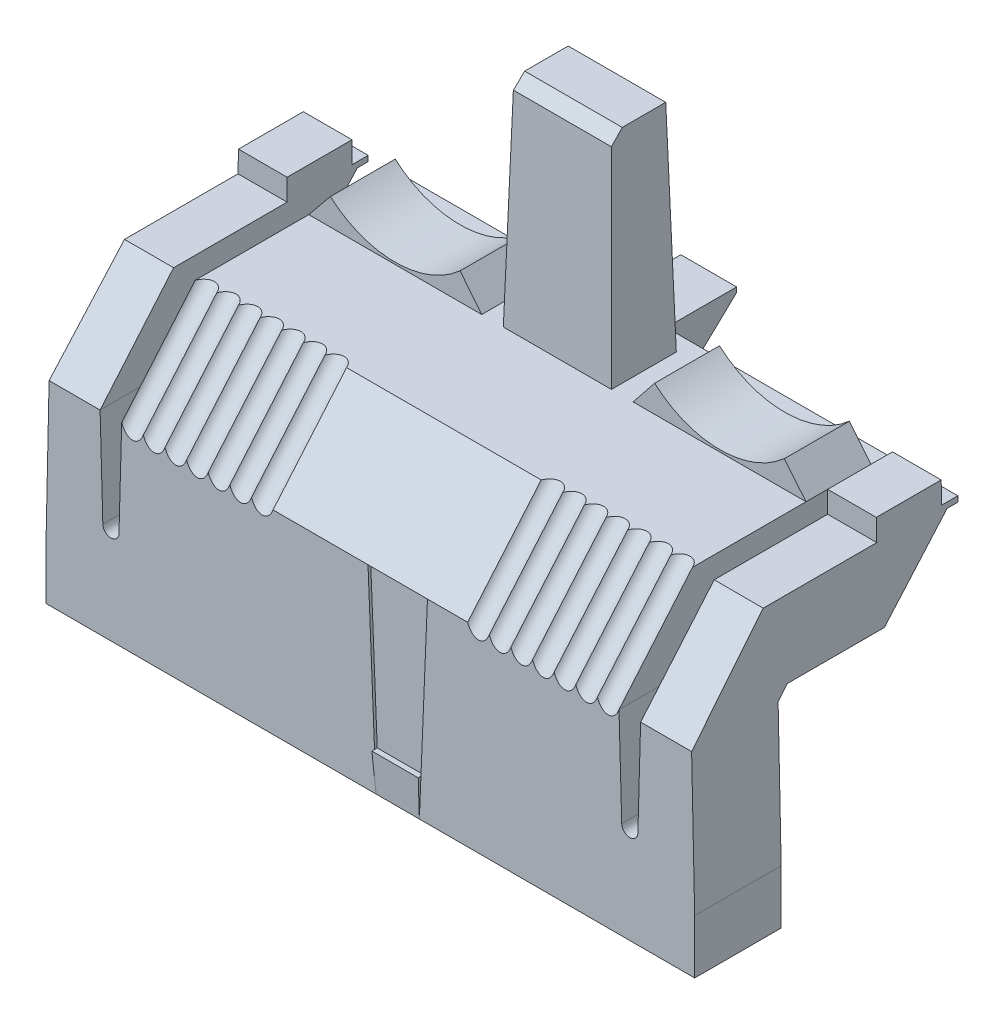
from build123d import *

# Parameters (mm, degrees)
EXTRUSION1_DEPTH        = 30
ENL_V_MAT_EXTRU_1_DEPTH = 54.019585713
ESQUISSE4_R             = 9
ENL_V_MAT_EXTRU_2_DEPTH = 54.019585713
D_POUILLE3_ANGLE        = 1.4
D_POUILLE4_ANGLE        = 1.4
D_POUILLE5_ANGLE        = 1.4
D_POUILLE6_ANGLE        = 1.4
CHANFREIN2_SIZE         = 1
CHANFREIN2_SIZE2        = 1.025357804
EXTRUSION2_DEPTH        = 2.25
ESQUISSE8_W             = 6.5
ESQUISSE8_H             = 0.5
EXTRUSION3_DEPTH        = 4.5
D_POUILLE7_ANGLE        = 2.7
D_POUILLE8_ANGLE        = 2.7
ENL_V_MAT_EXTRU_4_DEPTH = 0.25
EXTRUSION4_DEPTH        = 0.5
ENL_V_MAT_EXTRU_6_DEPTH = 55.234031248
EXTRUSION5_DEPTH        = 1
ESQUISSE13_W            = 1
ESQUISSE13_H            = 20.72029686
EXTRUSION6_DEPTH        = 1
ESQUISSE14_W            = 5
ESQUISSE14_H            = 3.5
ENL_V_MAT_EXTRU_8_DEPTH = 3
ENL_V_MAT_EXTRU_9_DEPTH = 25


with BuildPart() as part:
    # Esquisse1 → Extrusion1 (new, symmetric)
    with BuildSketch(Plane(origin=(0, 0, 0), x_dir=(0, 0, -1), z_dir=(1, 0, 0))):
        Polygon((-4, -10), (4, -10), (4, 8), (4.850091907, 9), (13.850091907, 9), (19.800735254, 15.5), (20.800735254, 15.5), (20.800735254, 16), (19.300735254, 16), (19.300735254, 36), (13.300735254, 36), (13.300735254, 16), (2.800735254, 16), (-4, 8), align=None)
    extrude(amount=EXTRUSION1_DEPTH, both=True)

    # Esquisse3 → Enl_v. mat.-Extru.1 (cut, through all)
    with BuildSketch(Plane.XY.offset(4)):
        with BuildLine():
            Line((-30, -5), (-30, 37.01927998))
            Line((-30, 37.01927998), (-5, 37.01927998))
            Line((-5, 37.01927998), (-5, 16))
            Line((-5, 16), (-7, 16))
            Line((-7, 16), (-9, 18.5))
            Line((-9, 18.5), (-21, 18.452773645))
            Line((-21, 18.452773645), (-23, 16))
            Line((-23, 16), (-23, 8))
            Line((-23, 8), (-23.25337766, -1.02097085))
            ThreePointArc((-23.25337766, -1.02097085), (-24.000000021, -1.746916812), (-24.746622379, -1.020970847))
            Line((-24.746622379, -1.020970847), (-25, 8))
            Line((-25, 8), (-25, 18))
            Line((-25, 18), (-29.5, 18))
            Line((-29.5, 18), (-30, -5))
        make_face()
        with BuildLine():
            Line((21, 18.452773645), (9, 18.5))
            Line((9, 18.5), (7, 16))
            Line((7, 16), (5, 16))
            Line((5, 16), (5, 37.01927998))
            Line((5, 37.01927998), (30, 37.01927998))
            Line((30, 37.01927998), (30, -5))
            Line((30, -5), (29.5, 18))
            Line((29.5, 18), (25, 18))
            Line((25, 18), (25, 8))
            Line((25, 8), (24.746622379, -1.020970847))
            ThreePointArc((24.746622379, -1.020970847), (24.000000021, -1.746916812), (23.25337766, -1.02097085))
            Line((23.25337766, -1.02097085), (23, 8))
            Line((23, 8), (23, 16))
            Line((23, 16), (21, 18.452773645))
        make_face()
    extrude(amount=-ENL_V_MAT_EXTRU_1_DEPTH, mode=Mode.SUBTRACT)

    # Esquisse4 → Enl_v. mat.-Extru.2 (cut, through all)
    with BuildSketch(Plane.XY.offset(4)):
        with Locations((-15.026399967, 25.184497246)):
            Circle(ESQUISSE4_R)
        with Locations((15.026399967, 25.184497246)):
            Circle(ESQUISSE4_R)
    extrude(amount=-ENL_V_MAT_EXTRU_2_DEPTH, mode=Mode.SUBTRACT)

    # D_pouille3
    d_pouille3_faces = [part.faces().sort_by_distance(p)[0] for p in [
        (-5, 26, -16.300735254),
    ]]
    draft(d_pouille3_faces, Plane(origin=(30, 16, -19.300735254), x_dir=(0, 0, 1), z_dir=(0, 1, 0)), D_POUILLE3_ANGLE)

    # D_pouille4
    d_pouille4_faces = [part.faces().sort_by_distance(p)[0] for p in [
        (0.12117695, 25.916494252, -13.300735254),
    ]]
    draft(d_pouille4_faces, Plane(origin=(30, 16, -19.300735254), x_dir=(0, 0, 1), z_dir=(0, 1, 0)), D_POUILLE4_ANGLE)

    # D_pouille5
    d_pouille5_faces = [part.faces().sort_by_distance(p)[0] for p in [
        (5, 25.85845987, -16.421203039),
    ]]
    draft(d_pouille5_faces, Plane(origin=(30, 16, -19.300735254), x_dir=(0, 0, 1), z_dir=(0, 1, 0)), D_POUILLE5_ANGLE)

    # D_pouille6
    d_pouille6_faces = [part.faces().sort_by_distance(p)[0] for p in [
        (0, 25.828697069, -19.300735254),
    ]]
    draft(d_pouille6_faces, Plane(origin=(30, 16, -19.300735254), x_dir=(0, 0, 1), z_dir=(0, 1, 0)), D_POUILLE6_ANGLE)

    # Chanfrein2
    chanfrein2_edges = [part.edges().sort_by_distance(p)[0] for p in [
        (0, 36, -13.789524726),
    ]]
    chanfrein2_side = [part.faces().sort_by_distance(p)[0] for p in [
        (0, 36, -16.300735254),
    ]]
    chamfer(chanfrein2_edges, length=CHANFREIN2_SIZE, length2=CHANFREIN2_SIZE2, reference=chanfrein2_side[0])

    # Esquisse7 → Extrusion2 (add, symmetric)
    with BuildSketch(Plane(origin=(0, 0, 0), x_dir=(0, 0, -1), z_dir=(1, 0, 0))):
        with BuildLine():
            Line((5.5, 6.5), (6, -2.5))
            Line((6, -2.5), (10, -2.5))
            Line((10, -2.5), (27.300735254, 15.5))
            Line((27.300735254, 15.5), (19.800735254, 15.5))
            Line((19.800735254, 15.5), (13.850091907, 9))
            Line((13.850091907, 9), (4.850091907, 9))
            Line((4.850091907, 9), (4, 8))
            ThreePointArc((4, 8), (5.036548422, 7.536548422), (5.5, 6.5))
        make_face()
    extrude(amount=EXTRUSION2_DEPTH, both=True)

    # Esquisse8 → Extrusion3 (add)
    with BuildSketch(Plane(origin=(2.25, 0, 0), x_dir=(0, 0, -1), z_dir=(1, 0, 0))):
        with Locations((24.050735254, 15.75)):
            Rectangle(ESQUISSE8_W, ESQUISSE8_H)
    extrude(amount=-EXTRUSION3_DEPTH)

    # D_pouille7
    d_pouille7_faces = [part.faces().sort_by_distance(p)[0] for p in [
        (2.25, 6.917239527, -14.030638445),
    ]]
    draft(d_pouille7_faces, Plane(origin=(30, 9, -4.850091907), x_dir=(0, 0, -1), z_dir=(0, -1, 0)), D_POUILLE7_ANGLE)

    # D_pouille8
    d_pouille8_faces = [part.faces().sort_by_distance(p)[0] for p in [
        (-2.25, 6.917239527, -14.030638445),
    ]]
    draft(d_pouille8_faces, Plane(origin=(30, 9, -4.850091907), x_dir=(0, 0, -1), z_dir=(0, -1, 0)), D_POUILLE8_ANGLE)

    # Esquisse9 → Enl_v. mat.-Extru.4 (cut)
    with BuildSketch(Plane.XY.offset(4)):
        Polygon((-0.217391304, 8), (0.532608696, -10), (4.532608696, -10), (5.282608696, 8), align=None)
    extrude(amount=-ENL_V_MAT_EXTRU_4_DEPTH, mode=Mode.SUBTRACT)

    # Esquisse10 → Extrusion4 (add)
    with BuildSketch(Plane.XY.offset(3.75)):
        Polygon((0.532608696, -10), (4.532608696, -10), (4.678442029, -6.5), (0.386775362, -6.5), align=None)
    extrude(amount=EXTRUSION4_DEPTH)

    # Esquisse11 → Enl_v. mat.-Extru.6 (cut, through all)
    with BuildSketch(Plane(origin=(0, 0, 0), x_dir=(0, 0, -1), z_dir=(1, 0, 0))):
        Polygon((-4.25, -6.5), (-4, -10), (-4.25, -10), align=None)
    extrude(amount=ENL_V_MAT_EXTRU_6_DEPTH, mode=Mode.SUBTRACT)

    # Esquisse12 → Extrusion5 (add)
    with BuildSketch(Plane(origin=(0, 0, -4), x_dir=(-1, 0, 0), z_dir=(0, 0, -1))):
        Polygon((28.8, 11.92915798), (28.2, -4), (27.2, -4), (26.6, 11.92915798), align=None)
        Polygon((-26.6, 11.92915798), (-28.8, 11.92915798), (-28.2, -4), (-27.2, -4), align=None)
    extrude(amount=EXTRUSION5_DEPTH)

    # Esquisse13 → Extrusion6 (add)
    with BuildSketch(Plane(origin=(0, 0, -4), x_dir=(-1, 0, 0), z_dir=(0, 0, -1))):
        with Locations((3.5, 0.86014843)):
            Rectangle(ESQUISSE13_W, ESQUISSE13_H)
    extrude(amount=EXTRUSION6_DEPTH)

    # Esquisse14 → Enl_v. mat.-Extru.8 (cut)
    with BuildSketch(Plane(origin=(0, 0.480969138, -19.680012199), x_dir=(-1, 0, 0), z_dir=(0, 0.024432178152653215, -0.9997014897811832))):
        with Locations((0, 29.779636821)):
            Rectangle(ESQUISSE14_W, ESQUISSE14_H)
    extrude(amount=-ENL_V_MAT_EXTRU_8_DEPTH, mode=Mode.SUBTRACT)

    # Esquisse15 → Enl_v. mat.-Extru.9 (cut, symmetric)
    with BuildSketch(Plane(origin=(0, 2.670081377, -2.269814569), x_dir=(-1, 0, 0), z_dir=(0, 0.7619047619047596, -0.6476890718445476))):
        with BuildLine():
            Line((9, 8.229131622), (9, 10.700565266))
            Line((9, 10.700565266), (23, 10.434083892))
            Line((23, 10.434083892), (23, 8.229131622))
            ThreePointArc((23, 8.229131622), (22, 7.635989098), (21, 8.229131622))
            ThreePointArc((21, 8.229131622), (20, 7.635989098), (19, 8.229131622))
            ThreePointArc((19, 8.229131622), (18, 7.635989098), (17, 8.229131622))
            ThreePointArc((17, 8.229131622), (16, 7.635989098), (15, 8.229131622))
            ThreePointArc((15, 8.229131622), (14, 7.635989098), (13, 8.229131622))
            ThreePointArc((13, 8.229131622), (12, 7.635989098), (11, 8.229131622))
            ThreePointArc((11, 8.229131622), (10, 7.635989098), (9, 8.229131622))
        make_face()
        with BuildLine():
            Line((-23, 10.434083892), (-23, 8.229131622))
            ThreePointArc((-23, 8.229131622), (-22, 7.635989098), (-21, 8.229131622))
            ThreePointArc((-21, 8.229131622), (-20, 7.635989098), (-19, 8.229131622))
            ThreePointArc((-19, 8.229131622), (-18, 7.635989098), (-17, 8.229131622))
            ThreePointArc((-17, 8.229131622), (-16, 7.635989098), (-15, 8.229131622))
            ThreePointArc((-15, 8.229131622), (-14, 7.635989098), (-13, 8.229131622))
            ThreePointArc((-13, 8.229131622), (-12, 7.635989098), (-11, 8.229131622))
            ThreePointArc((-11, 8.229131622), (-10, 7.635989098), (-9, 8.229131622))
            Line((-9, 8.229131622), (-9, 10.700565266))
            Line((-9, 10.700565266), (-23, 10.434083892))
        make_face()
    extrude(amount=ENL_V_MAT_EXTRU_9_DEPTH, both=True, mode=Mode.SUBTRACT)


solid = part.part
